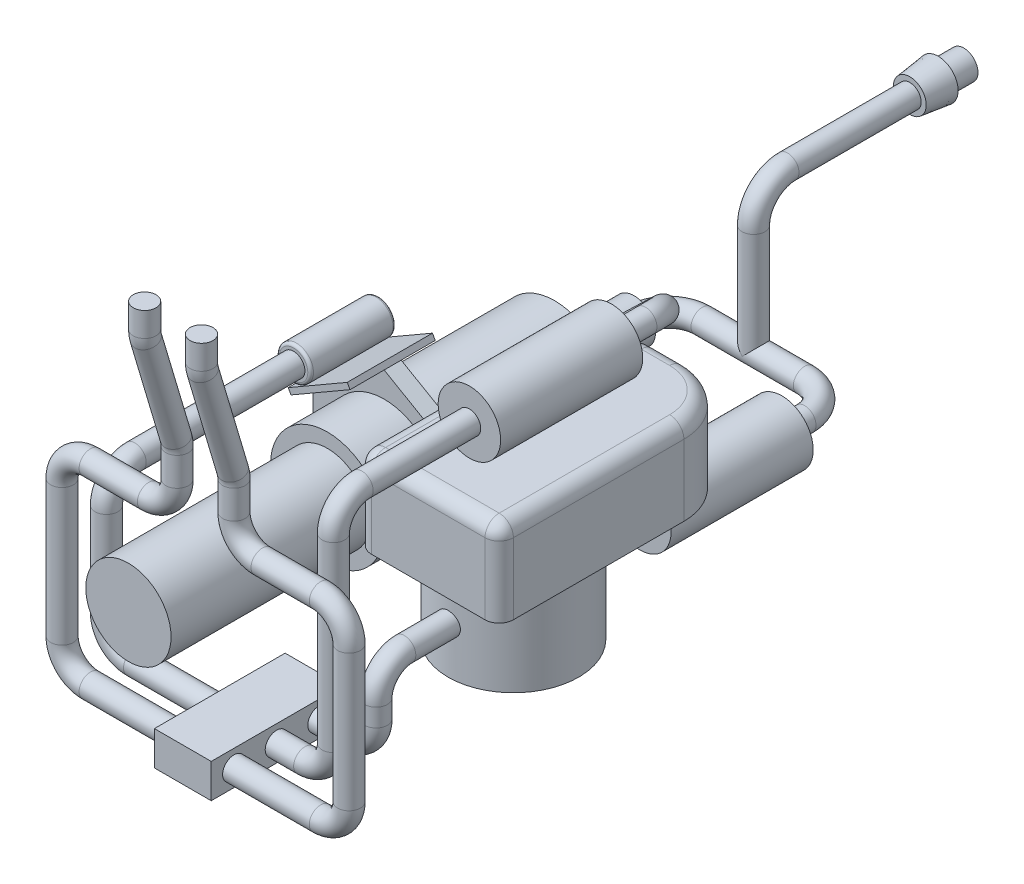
from build123d import *

# Parameters (mm, degrees)
ESQUISSE1_R                = 15
BOSS_EXTRU_1_DEPTH         = 70
ESQUISSE2_R                = 20
BOSS_EXTRU_2_DEPTH         = 80
BOSS_EXTRU_4_DEPTH         = 15
BOSS_EXTRU_4_DEPTH_BACK    = 16
ESQUISSE8_R                = 23
BOSS_EXTRU_5_DEPTH         = 30
CONG_1_R                   = 5
BOSS_EXTRU_3_START         = -40
ESQUISSE5_R                = 11
BOSS_EXTRU_3_DEPTH         = 50
ESQUISSE11_R               = 4
ESQUISSE13_R               = 4
ESQUISSE15_R               = 4
BOSS_EXTRU_6_START         = -20
ESQUISSE16_W               = 20
ESQUISSE16_H               = 46
BOSS_EXTRU_6_DEPTH         = 12
BOSS_EXTRU_7_START         = -20.5
ESQUISSE17_R               = 4
BOSS_EXTRU_7_DEPTH         = 21
R_P_TITION_LIN_AIRE1_COUNT = 3
R_P_TITION_LIN_AIRE1_PITCH = 15
ESQUISSE18_R               = 4
ESQUISSE19_R               = 4
ESQUISSE21_R               = 4
BOSS_EXTRU_8_START         = -20
ESQUISSE22_R               = 20
BOSS_EXTRU_8_DEPTH         = 6
ESQUISSE23_W               = 24
ESQUISSE23_H               = 30
BOSS_EXTRU_9_DEPTH         = 2
ESQUISSE24_R               = 6
BOSS_EXTRU_10_DEPTH        = 30
CONG_2_R                   = 1
ESQUISSE27_R               = 4
ESQUISSE28_R               = 7
BOSS_EXTRU_11_DEPTH        = 10
BOSS_EXTRU_11_DRAFT        = -7
ESQUISSE29_R               = 5
BOSS_EXTRU_12_DEPTH        = 9
BOSS_EXTRU_13_DEPTH        = 20
BOSS_EXTRU_13_DEPTH_BACK   = 30
ESQUISSE30_R               = 11
BOSS_EXTRU_14_START        = 8
ESQUISSE31_R               = 7.5
BOSS_EXTRU_14_DEPTH        = 20


with BuildPart() as part:
    # Esquisse1 → Boss.-Extru.1 (new body)
    with BuildSketch(Plane.XY):
        Circle(ESQUISSE1_R)
    extrude(amount=BOSS_EXTRU_1_DEPTH)

    # Esquisse2 → Boss.-Extru.2 (add)
    with BuildSketch(Plane(origin=(0, 0, 0), x_dir=(-1, 0, 0), z_dir=(0, 0, -1))):
        Circle(ESQUISSE2_R)
    extrude(amount=BOSS_EXTRU_2_DEPTH)



with BuildPart() as body_2:
    # Esquisse8 → Boss.-Extru.4 (new, two sides: drawn at the far end of the back side and taken through both)
    with BuildSketch(Plane(origin=(0, 0, 0), x_dir=(1, 0, 0), z_dir=(0, 1, 0)).offset(-BOSS_EXTRU_4_DEPTH_BACK)):
        with Locations(Location((60, 5.485082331, 0), (0, 0, 270))):
            Circle(ESQUISSE8_R)
    extrude(amount=BOSS_EXTRU_4_DEPTH + BOSS_EXTRU_4_DEPTH_BACK)

    # Esquisse9 → Boss.-Extru.5 (add)
    with BuildSketch(Plane(origin=(0, 15, 0), x_dir=(1, 0, 0), z_dir=(0, 1, 0))):
        with BuildLine():
            Line((55, 60.485082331), (65, 60.485082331))
            ThreePointArc((65, 60.485082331), (79.142135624, 54.627217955), (85, 40.485082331))
            Line((85, 40.485082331), (85, -24.514917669))
            Line((85, -24.514917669), (35, -24.514917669))
            Line((35, -24.514917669), (35, 40.485082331))
            ThreePointArc((35, 40.485082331), (40.857864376, 54.627217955), (55, 60.485082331))
        make_face()
    extrude(amount=BOSS_EXTRU_5_DEPTH)

    # Cong_1
    cong_1_edges = [body_2.edges().sort_by_distance(p)[0] for p in [
        (35, 30, 24.514917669),
        (85, 45, -7.985082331),
        (79.142135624, 45, -54.627217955),
        (60, 45, -60.485082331),
        (40.857864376, 45, -54.627217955),
        (35, 45, -7.985082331),
        (60, 45, 24.514917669),
        (85, 30, 24.514917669),
    ]]
    fillet(cong_1_edges, radius=CONG_1_R)


with BuildPart() as body_3:
    # Esquisse5 → Boss.-Extru.3 (new body)
    with BuildSketch(Plane(origin=(0, 0, -80), x_dir=(-1, 0, 0), z_dir=(0, 0, -1)).offset(BOSS_EXTRU_3_START)):
        with Locations((-60, 58)):
            Circle(ESQUISSE5_R)
    extrude(amount=-BOSS_EXTRU_3_DEPTH)


with BuildPart() as part_1:
    add(part.part)

    add(body_2.part)  # Balayage1 merges body 2
    # Balayage1: sweep along a path in Esquisse10
    with BuildLine(Plane(origin=(0, 0, 0), x_dir=(1, 0, 0), z_dir=(0, 1, 0))) as balayage1_path:
        Line((0, 80), (0, 108))
        ThreePointArc((0, 108), (3.514718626, 116.485281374), (12, 120))
        Line((12, 120), (48, 120))
        ThreePointArc((48, 120), (56.485281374, 116.485281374), (60, 108))
        Line((60, 108), (60, 21.475881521))
    # Esquisse11 → Balayage1 (sweep)
    with BuildSketch(Plane(origin=(0, 0, -80), x_dir=(-1, 0, 0), z_dir=(0, 0, -1))):
        Circle(ESQUISSE11_R)
    sweep(path=balayage1_path.line)


    add(body_3.part)  # Balayage2 merges body 3
    # Balayage2: sweep along a path in Esquisse12
    with BuildLine(Plane(origin=(0, 0, 0), x_dir=(-0.7189883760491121, -0.6950220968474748, 0), z_dir=(-0.6950220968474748, 0.7189883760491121, 0))) as balayage2_path:
        Line((-83.45058418, -40), (-83.45058418, -52))
        ThreePointArc((-83.45058418, -52), (-79.935865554, -60.485281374), (-71.45058418, -64))
        Line((-71.45058418, -64), (0, -64))
    # Esquisse13 → Balayage2 (sweep)
    with BuildSketch(Plane(origin=(0, 0, -40), x_dir=(-1, 0, 0), z_dir=(0, 0, -1))):
        with Locations((-60, 58)):
            Circle(ESQUISSE13_R)
    sweep(path=balayage2_path.line)

    # Balayage3: sweep along a path in Esquisse14
    with BuildLine(Plane(origin=(30, 0, 0), x_dir=(0, 0, -1), z_dir=(1, 0, 0))) as balayage3_path:
        Line((120, 0), (120, 38))
        ThreePointArc((120, 38), (123.514718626, 46.485281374), (132, 50))
        Line((132, 50), (185, 50))
    # Esquisse15 → Balayage3 (sweep)
    with BuildSketch(Plane(origin=(0, 0, 0), x_dir=(1, 0, 0), z_dir=(0, 1, 0))):
        with Locations((30, 120)):
            Circle(ESQUISSE15_R)
    sweep(path=balayage3_path.line)



with BuildPart() as body_2_2:
    # Esquisse16 → Boss.-Extru.6 (new body)
    with BuildSketch(Plane(origin=(0, 0, 0), x_dir=(1, 0, 0), z_dir=(0, 1, 0)).offset(BOSS_EXTRU_6_START)):
        with Locations((30, -57.855523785)):
            Rectangle(ESQUISSE16_W, ESQUISSE16_H)
    extrude(amount=-BOSS_EXTRU_6_DEPTH)

    # Esquisse17 → Boss.-Extru.7 (add)
    with BuildSketch(Plane(origin=(40, 0, 0), x_dir=(0, 0, -1), z_dir=(1, 0, 0)).offset(BOSS_EXTRU_7_START)):
        with Locations((-72.855523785, -26)):
            Circle(ESQUISSE17_R)
    boss_extru_7 = extrude(amount=BOSS_EXTRU_7_DEPTH)

    # R_p_tition lin_aire1: Boss.-Extru.7 ×3
    with Locations(*[(0, 0, -i * R_P_TITION_LIN_AIRE1_PITCH) for i in range(1, R_P_TITION_LIN_AIRE1_COUNT)]):
        add(boss_extru_7)


with BuildPart() as part_2:
    add(part_1.part)

    add(body_2_2.part)  # Balayage4 merges body 2 2
    # Balayage4: sweep along a curve in space
    with BuildLine() as balayage4_path:
        Line((60, 58, 10), (60, 58, 47.855523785))
        ThreePointArc((60, 58, 47.855523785), (60, 55.071067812, 54.926591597), (60, 48, 57.855523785))
        Line((60, 48, 57.855523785), (60, -16, 57.855523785))
        ThreePointArc((60, -16, 57.855523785), (57.071067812, -23.071067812, 57.855523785), (50, -26, 57.855523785))
        Line((50, -26, 57.855523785), (40.5, -26, 57.855523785))
    # Esquisse18 → Balayage4 (sweep)
    with BuildSketch(Plane(origin=(40.5, 0, 0), x_dir=(0, 0, -1), z_dir=(1, 0, 0))):
        with Locations((-57.855523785, -26)):
            Circle(ESQUISSE18_R)
    sweep(path=balayage4_path.line)

    # Balayage5: sweep along a curve in space
    with BuildLine() as balayage5_path:
        Line((40.5, -26, 42.855523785), (50, -26, 42.855523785))
        ThreePointArc((50, -26, 42.855523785), (57.071067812, -23.071067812, 42.855523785), (60, -16, 42.855523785))
        Line((60, -16, 42.855523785), (60, -9.64560031, 42.855523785))
        ThreePointArc((60, -9.64560031, 42.855523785), (60, -2.574532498, 39.926591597), (60, 0.35439969, 32.855523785))
        Line((60, 0.35439969, 32.855523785), (60, 0.35439969, -5.485082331))
    # Esquisse19 → Balayage5 (sweep)
    with BuildSketch(Plane(origin=(40.5, 0, 0), x_dir=(0, 0, -1), z_dir=(1, 0, 0))):
        with Locations((-42.855523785, -26)):
            Circle(ESQUISSE19_R)
    sweep(path=balayage5_path.line)

    # Balayage6: sweep along a curve in space
    with BuildLine() as balayage6_path:
        Line((19.5, -26, 72.855523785), (-10.5, -26, 72.855523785))
        ThreePointArc((-10.5, -26, 72.855523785), (-17.571067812, -23.071067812, 72.855523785), (-20.5, -16, 72.855523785))
        Line((-20.5, -16, 72.855523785), (-20.5, 32.05, 72.855523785))
        ThreePointArc((-20.5, 32.05, 72.855523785), (-17.571067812, 39.121067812, 72.855523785), (-10.5, 42.05, 72.855523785))
        Line((-10.5, 42.05, 72.855523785), (10, 42.05, 72.855523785))
        ThreePointArc((10, 42.05, 72.855523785), (17.071067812, 44.978932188, 72.855523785), (20, 52.05, 72.855523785))
        Line((20, 52.05, 72.855523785), (20, 62.094970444, 72.855523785))
        ThreePointArc((20, 62.094970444, 72.855523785), (20, 63.534838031, 72.959727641), (20, 64.944697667, 73.270167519))
        Line((20, 64.944697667, 73.270167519), (20, 100.568535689, 83.861137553))
        ThreePointArc((20, 100.568535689, 83.861137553), (20, 101.978395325, 84.171577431), (20, 103.418262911, 84.275781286))
        Line((20, 103.418262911, 84.275781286), (20, 111.963233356, 84.275781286))
    # Esquisse21 → Balayage6 (sweep)
    with BuildSketch(Plane.ZY.offset(-19.5)):
        with Locations((72.855523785, -26)):
            Circle(ESQUISSE21_R)
    balayage6 = sweep(path=balayage6_path.line)

    # Sym_trie2: Balayage6 across plane
    add(balayage6.mirror(Plane(origin=(30, 0, 0), x_dir=(0, 0, 1), z_dir=(1, 0, 0))))

    # Esquisse22 → Boss.-Extru.8 (add)
    with BuildSketch(Plane.XY.offset(BOSS_EXTRU_8_START)):
        Polygon((0, 28.867513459), (-25, 14.43375673), (-25, -14.43375673), (0, -28.867513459), (25, -14.43375673), (25, 14.43375673), align=None)
        Circle(ESQUISSE22_R, mode=Mode.SUBTRACT)
    extrude(amount=-BOSS_EXTRU_8_DEPTH)

    # Esquisse23 → Boss.-Extru.9 (add)
    with BuildSketch(Plane(origin=(-12.5, 21.650635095, 0), x_dir=(0.8660254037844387, 0.4999999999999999, 0), z_dir=(-0.49999999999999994, 0.8660254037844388, 0))):
        with Locations((2.43375673, 23)):
            Rectangle(ESQUISSE23_W, ESQUISSE23_H)
    extrude(amount=BOSS_EXTRU_9_DEPTH)



with BuildPart() as body_2_3:
    # Esquisse24 → Boss.-Extru.10 (new body)
    with BuildSketch(Plane.XY.offset(-8)):
        with Locations((-19.871438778, 26.643884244)):
            Circle(ESQUISSE24_R)
    extrude(amount=-BOSS_EXTRU_10_DEPTH)

    # Cong_2
    cong_2_edges = [body_2_3.edges().sort_by_distance(p)[0] for p in [
        (-25.871438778, 26.643884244, -8),
        (-25.871438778, 26.643884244, -38),
    ]]
    fillet(cong_2_edges, radius=CONG_2_R)


with BuildPart() as part_3:
    add(part_2.part)

    add(body_2_3.part)  # Balayage15 merges body 2 3
    # Balayage15: sweep along a curve in space
    with BuildLine() as balayage15_path:
        Line((-19.871438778, 26.643884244, -8), (-19.871438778, 26.643884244, 47.855523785))
        ThreePointArc((-19.871438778, 26.643884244, 47.855523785), (-19.871438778, 23.714952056, 54.926591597), (-19.871438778, 16.643884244, 57.855523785))
        Line((-19.871438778, 16.643884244, 57.855523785), (-19.871438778, -16, 57.855523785))
        ThreePointArc((-19.871438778, -16, 57.855523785), (-16.942506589, -23.071067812, 57.855523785), (-9.871438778, -26, 57.855523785))
        Line((-9.871438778, -26, 57.855523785), (20, -26, 57.855523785))
    # Esquisse27 → Balayage15 (sweep)
    with BuildSketch(Plane.XY.offset(-8)):
        with Locations((-19.871438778, 26.643884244)):
            Circle(ESQUISSE27_R)
    sweep(path=balayage15_path.line)


with BuildPart() as boss_extru_11_tool:
    # Esquisse28 → Boss.-Extru.11 (with draft: the straight prism first)
    with BuildSketch(Plane(origin=(0, 0, -185), x_dir=(-1, 0, 0), z_dir=(0, 0, -1))):
        with Locations((-30, 50)):
            Circle(ESQUISSE28_R)
    extrude(amount=-BOSS_EXTRU_11_DEPTH)
    # Boss.-Extru.11: the draft: its side faces are tilted about the plane it starts from
    boss_extru_11_sides = [boss_extru_11_tool.faces().sort_by_distance(p)[0] for p in [
        (37, 50, -180),
    ]]
    draft(boss_extru_11_sides, Plane(origin=(0, 0, -185), x_dir=(-1, 0, 0), z_dir=(0, 0, -1)), BOSS_EXTRU_11_DRAFT)


with BuildPart() as part_4:
    add(part_3.part)

    # Boss.-Extru.11: add boss_extru_11_tool
    add(boss_extru_11_tool.part)

    # Esquisse29 → Boss.-Extru.12 (add)
    with BuildSketch(Plane(origin=(0, 0, -185), x_dir=(-1, 0, 0), z_dir=(0, 0, -1))):
        with Locations(Location((-30, 50, 0), (0, 0, 90))):
            Circle(ESQUISSE29_R)
    extrude(amount=BOSS_EXTRU_12_DEPTH)


with BuildPart() as body_2_4:
    # Esquisse30 → Boss.-Extru.13 (new, two sides: drawn at the far end of the back side and taken through both)
    with BuildSketch(Plane(origin=(0, 0, -80), x_dir=(-1, 0, 0), z_dir=(0, 0, -1)).offset(-BOSS_EXTRU_13_DEPTH_BACK)):
        with Locations((-60, 0)):
            Circle(ESQUISSE30_R)
    extrude(amount=BOSS_EXTRU_13_DEPTH + BOSS_EXTRU_13_DEPTH_BACK)


with BuildPart() as body_3_2:
    # Esquisse31 → Boss.-Extru.14 (new body)
    with BuildSketch(Plane(origin=(0, 0, -80), x_dir=(-1, 0, 0), z_dir=(0, 0, -1)).offset(BOSS_EXTRU_14_START)):
        Circle(ESQUISSE31_R)
    extrude(amount=BOSS_EXTRU_14_DEPTH)


solid = Compound([part_4.part, body_2_4.part, body_3_2.part])
